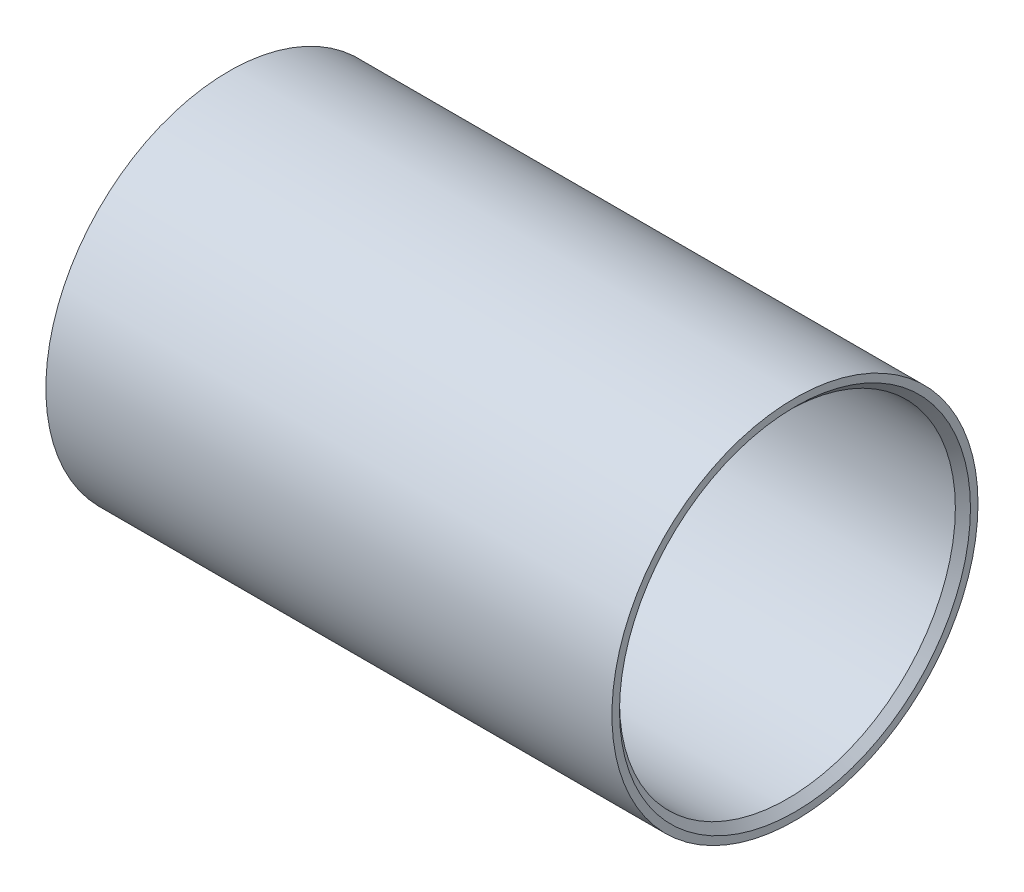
from build123d import *

# Parameters (mm, degrees)
SKETCH1_R      = 48.5
SKETCH1_R_2    = 44.5
EXTRUDE1_DEPTH = 75
CHAMFER1_SIZE  = 2


with BuildPart() as part:
    # Sketch1 → Extrude1 (new, symmetric)
    with BuildSketch(Plane(origin=(0, 0, 0), x_dir=(0, 0, -1), z_dir=(1, 0, 0))):
        Circle(SKETCH1_R)
        Circle(SKETCH1_R_2, mode=Mode.SUBTRACT)
    extrude(amount=EXTRUDE1_DEPTH, both=True)

    # Chamfer1
    chamfer1_edges = [part.edges().sort_by_distance(p)[0] for p in [
        (-75, 0, 44.5),
        (75, 0, 44.5),
    ]]
    chamfer(chamfer1_edges, length=CHAMFER1_SIZE)


solid = part.part
